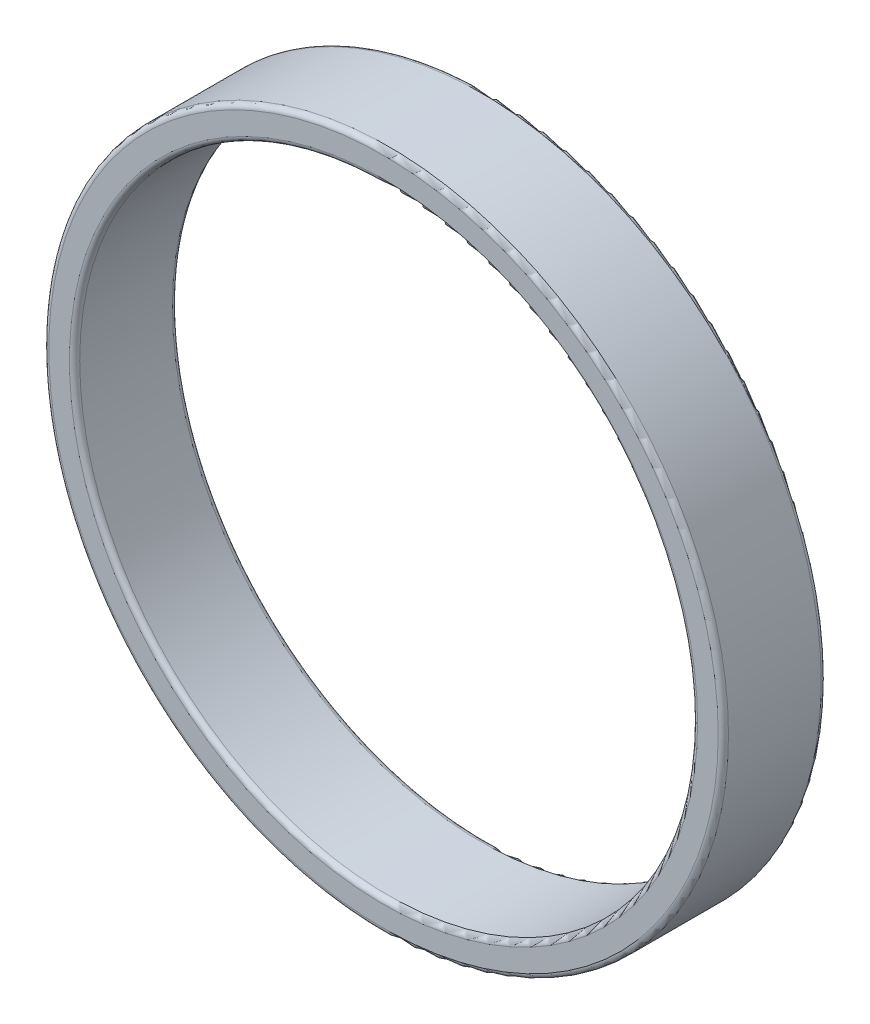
from build123d import *

# Parameters (mm, degrees)
SKETCH1_R           = 41.91
SKETCH1_R_2         = 38.1
BOSS_EXTRUDE1_DEPTH = 6.35
FILLET1_R           = 0.635


with BuildPart() as part:
    # Sketch1 → Boss-Extrude1 (new, symmetric)
    with BuildSketch(Plane.XY):
        Circle(SKETCH1_R)
        Circle(SKETCH1_R_2, mode=Mode.SUBTRACT)
    extrude(amount=BOSS_EXTRUDE1_DEPTH, both=True)

    # Fillet1
    fillet1_edges = [part.edges().sort_by_distance(p)[0] for p in [
        (-41.91, 0, -6.35),
        (-41.91, 0, 6.35),
        (-38.1, 0, -6.35),
        (-38.1, 0, 6.35),
    ]]
    fillet(fillet1_edges, radius=FILLET1_R)


solid = part.part
